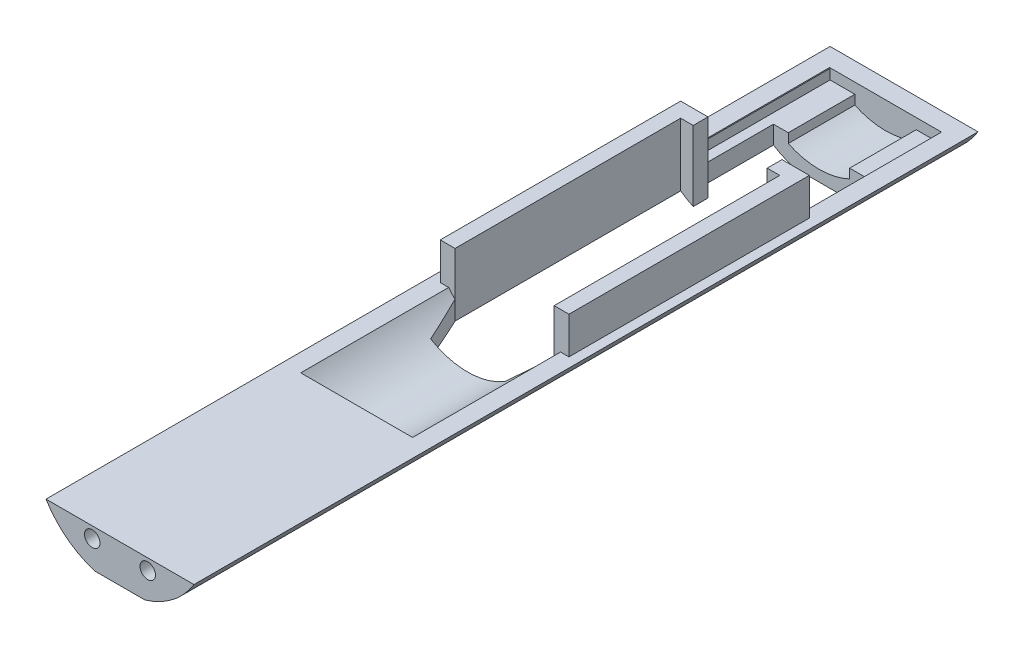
from build123d import *

# Parameters (mm, degrees)
BOSS_EXTRUDE1_DEPTH             = 457.2
PIXHAWK_PLATFORM_REACH          = 460.128
SKETCH3_W                       = 50.8
SKETCH3_H                       = 81.28
BOSS_EXTRUDE3_REACH             = 460.128
BOSS_EXTRUDE3_END_RADIUS        = 24.638
BOSS_EXTRUDE3_DIRECTION_2_DEPTH = 12.7
BOSS_EXTRUDE4_REACH             = 460.128
SKETCH6_W                       = 50.8
SKETCH6_H                       = 6.35
CUT_EXTRUDE2_DEPTH              = 459.69979452
SKETCH8_W                       = 177.8
SKETCH8_H                       = 228.6
CUT_EXTRUDE3_DEPTH              = 459.127958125
SKETCH9_W                       = 38.1
SKETCH9_H                       = 38.1
CUT_EXTRUDE4_DEPTH              = 48.26
SKETCH10_W                      = 25.4
SKETCH10_H                      = 5.08
CUT_EXTRUDE5_DEPTH              = 459.69979452
SKETCH11_W                      = 31.249226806
SKETCH11_H                      = 25.4
CUT_EXTRUDE6_DEPTH              = 459.195845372
BOSS_EXTRUDE5_REACH             = 460.196
BOSS_EXTRUDE5_END_RADIUS        = 24.638
SKETCH12_W                      = 5.08
SKETCH12_H                      = 22.86
SKETCH15_R                      = 2.65
CUT_EXTRUDE7_DEPTH              = 8
CUT_EXTRUDE9_DEPTH              = 273.06340644


with BuildPart() as part:
    # Sketch2 → Boss-Extrude1 (new body)
    with BuildSketch(Plane.XY):
        with BuildLine():
            Line((-19.210193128, -15.427233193), (-25.4, -15.427233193))
            ThreePointArc((-25.4, -15.427233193), (0, -29.718), (25.4, -15.427233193))
            Line((25.4, -15.427233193), (19.210193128, -15.427233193))
            ThreePointArc((19.210193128, -15.427233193), (0, -24.638), (-19.210193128, -15.427233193))
        make_face()
    extrude(amount=-BOSS_EXTRUDE1_DEPTH)

    # Sketch3 → Pixhawk Platform (add, up to next)
    with BuildSketch(Plane(origin=(0, -15.427233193, 0), x_dir=(1, 0, 0), z_dir=(0, 1, 0)), mode=Mode.PRIVATE) as pixhawk_platform_sk1:
        with Locations((0, 228.6)):
            Rectangle(SKETCH3_W, SKETCH3_H)
    pixhawk_platform_tool1 = extrude(pixhawk_platform_sk1.sketch, amount=-PIXHAWK_PLATFORM_REACH, mode=Mode.PRIVATE) - part.part
    add(pixhawk_platform_tool1.solids().sort_by_distance((0, -15.427233, -228.6))[0])

    # Boss-Extrude3: up to this cylinder (the profile starts inside it)
    boss_extrude3_end = Plane(origin=(0, 0, -398.446365), z_dir=(0, 0, 1)) * Cylinder(BOSS_EXTRUDE3_END_RADIUS, 970.532, mode=Mode.PRIVATE)
    # Sketch5 → Boss-Extrude3 (add, up to the surface)
    with BuildSketch(Plane(origin=(0, -15.427233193, 0), x_dir=(1, 0, 0), z_dir=(0, 1, 0)), mode=Mode.PRIVATE) as boss_extrude3_sk1:
        Polygon((-17.018, 397.51), (17.018, 397.51), (17.018, 320.04), (22.098, 320.04), (22.098, 402.59), (-22.098, 402.59), (-22.098, 320.04), (-17.018, 320.04), align=None)
    boss_extrude3_tool1 = extrude(boss_extrude3_sk1.sketch, amount=-BOSS_EXTRUDE3_REACH, mode=Mode.PRIVATE) & boss_extrude3_end
    add(boss_extrude3_tool1.solids().sort_by_distance((0, -15.427233, -398.446365))[0])

    # Sketch5 → Boss-Extrude3 direction 2 (add)
    with BuildSketch(Plane(origin=(0, -15.427233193, 0), x_dir=(1, 0, 0), z_dir=(0, 1, 0))):
        Polygon((-17.018, 397.51), (17.018, 397.51), (17.018, 320.04), (22.098, 320.04), (22.098, 402.59), (-22.098, 402.59), (-22.098, 320.04), (-17.018, 320.04), align=None)
    extrude(amount=BOSS_EXTRUDE3_DIRECTION_2_DEPTH)

    # Sketch6 → Boss-Extrude4 (add, up to next)
    with BuildSketch(Plane(origin=(0, -15.427233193, 0), x_dir=(1, 0, 0), z_dir=(0, 1, 0)), mode=Mode.PRIVATE) as boss_extrude4_sk1:
        with Locations((0, 454.025)):
            Rectangle(SKETCH6_W, SKETCH6_H)
    boss_extrude4_tool1 = extrude(boss_extrude4_sk1.sketch, amount=-BOSS_EXTRUDE4_REACH, mode=Mode.PRIVATE) - part.part
    add(boss_extrude4_tool1.solids().sort_by_distance((0, -15.427233, -454.025))[0])

    # Sketch7 → Cut-Extrude2 (cut, through all)
    with BuildSketch(Plane(origin=(0, -2.727233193, 0), x_dir=(1, 0, 0), z_dir=(0, 1, 0))):
        Polygon((-17.018, 397.51), (17.018, 397.51), (17.018, 320.04), (12.7, 307.34), (-12.7, 307.34), (-17.018, 320.04), align=None)
    extrude(amount=-CUT_EXTRUDE2_DEPTH, mode=Mode.SUBTRACT)

    # Sketch8 → Cut-Extrude3 (cut, through all)
    with BuildSketch(Plane(origin=(0, -15.427233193, 0), x_dir=(1, 0, 0), z_dir=(0, 1, 0))):
        with Locations((0, 73.66)):
            Rectangle(SKETCH8_W, SKETCH8_H)
    extrude(amount=-CUT_EXTRUDE3_DEPTH, mode=Mode.SUBTRACT)

    # Sketch9 → Cut-Extrude4 (cut)
    with BuildSketch(Plane(origin=(0, 0, -450.85), x_dir=(-1, 0, 0), z_dir=(0, 0, -1))):
        Rectangle(SKETCH9_W, SKETCH9_H)
    extrude(amount=-CUT_EXTRUDE4_DEPTH, mode=Mode.SUBTRACT)

    # Sketch10 → Cut-Extrude5 (cut, through all)
    with BuildSketch(Plane(origin=(0, -2.727233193, 0), x_dir=(1, 0, 0), z_dir=(0, 1, 0))):
        with Locations((0, 400.05)):
            Rectangle(SKETCH10_W, SKETCH10_H)
    extrude(amount=-CUT_EXTRUDE5_DEPTH, mode=Mode.SUBTRACT)

    # Sketch11 → Cut-Extrude6 (cut, through all)
    with BuildSketch(Plane(origin=(0, -19.05, 0), x_dir=(1, 0, 0), z_dir=(0, 1, 0))):
        with Locations((0, 415.29)):
            Rectangle(SKETCH11_W, SKETCH11_H)
    extrude(amount=-CUT_EXTRUDE6_DEPTH, mode=Mode.SUBTRACT)

    # Boss-Extrude5: up to this cylinder (the profile starts inside it)
    boss_extrude5_end = Plane(origin=(0, 0, -439.42), z_dir=(0, 0, 1)) * Cylinder(BOSS_EXTRUDE5_END_RADIUS, 970.668, mode=Mode.PRIVATE)
    # Sketch12 → Boss-Extrude5 (add, up to the surface)
    with BuildSketch(Plane(origin=(0, -19.05, 0), x_dir=(1, 0, 0), z_dir=(0, 1, 0)), mode=Mode.PRIVATE) as boss_extrude5_sk1:
        with Locations((-13.084613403, 439.42)):
            Rectangle(SKETCH12_W, SKETCH12_H)
    boss_extrude5_tool1 = extrude(boss_extrude5_sk1.sketch, amount=-BOSS_EXTRUDE5_REACH, mode=Mode.PRIVATE) & boss_extrude5_end
    add(boss_extrude5_tool1.solids().sort_by_distance((-13.084613, -19.05, -439.42))[0])
    # Sketch12 → Boss-Extrude5 (add, up to the surface)
    with BuildSketch(Plane(origin=(0, -19.05, 0), x_dir=(1, 0, 0), z_dir=(0, 1, 0)), mode=Mode.PRIVATE) as boss_extrude5_sk2:
        with Locations((13.084613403, 439.42)):
            Rectangle(SKETCH12_W, SKETCH12_H)
    boss_extrude5_tool2 = extrude(boss_extrude5_sk2.sketch, amount=-BOSS_EXTRUDE5_REACH, mode=Mode.PRIVATE) & boss_extrude5_end
    add(boss_extrude5_tool2.solids().sort_by_distance((13.084613, -19.05, -439.42))[0])

    # Sketch15 → Cut-Extrude7 (cut)
    with BuildSketch(Plane(origin=(-641.86826576, -879.841250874, -187.96), x_dir=(1, 0, 0), z_dir=(0, 0, 1))):
        with Locations((632.34326576, 860.604017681)):
            Circle(SKETCH15_R)
        with Locations((651.39326576, 860.604017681)):
            Circle(SKETCH15_R)
    extrude(amount=-CUT_EXTRUDE7_DEPTH, mode=Mode.SUBTRACT)

    # Sketch17 → Cut-Extrude9 (cut, through all)
    with BuildSketch(Plane.XY.offset(-187.96)):
        with BuildLine():
            ThreePointArc((8.594813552, -28.448), (4.34406837, -29.398785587), (0, -29.718))
            ThreePointArc((0, -29.718), (-4.34406837, -29.398785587), (-8.594813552, -28.448))
            Line((-8.594813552, -28.448), (-24.407539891, -28.448))
            Line((-24.407539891, -28.448), (-24.407539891, -41.03863297))
            Line((-24.407539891, -41.03863297), (24.407539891, -41.03863297))
            Line((24.407539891, -41.03863297), (24.407539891, -28.448))
            Line((24.407539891, -28.448), (8.594813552, -28.448))
        make_face()
        with BuildLine():
            ThreePointArc((-8.594813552, -28.448), (-4.34406837, -29.398785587), (0, -29.718))
            Line((0, -29.718), (0, -28.448))
            Line((0, -28.448), (-8.594813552, -28.448))
        make_face()
        with BuildLine():
            Line((0, -28.448), (0, -29.718))
            ThreePointArc((0, -29.718), (4.34406837, -29.398785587), (8.594813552, -28.448))
            Line((8.594813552, -28.448), (0, -28.448))
        make_face()
    extrude(amount=-CUT_EXTRUDE9_DEPTH, mode=Mode.SUBTRACT)


solid = part.part
